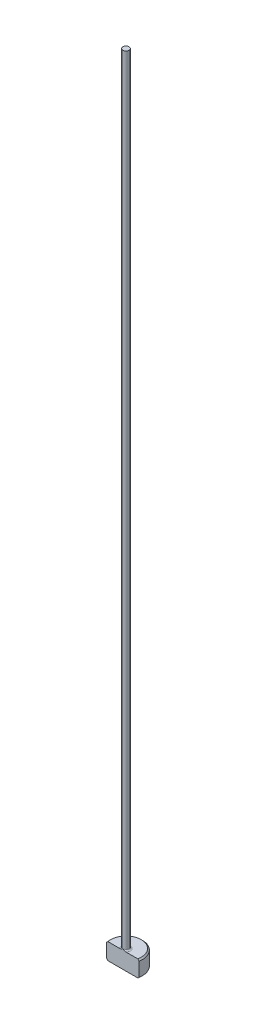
from build123d import *

# Parameters (mm, degrees)
CHAMFER1_SIZE = 0.254
FILLET1_R     = 0.254
KEY_DEPTH     = 153.466131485


with BuildPart() as part:
    # Sketch1 → Revolve1 (revolve)
    with BuildSketch(Plane.XY, mode=Mode.PRIVATE) as revolve1_sk:
        Polygon((0, 0), (-3.175, 0), (-3.175, 3.175), (-0.59436, 3.175), (-0.59436, 152.4), (0, 152.4), align=None)
    revolve(revolve1_sk.sketch.rotate(Axis((0, 259.958771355, 0), (0, -1, 0)), 270), axis=Axis((0, 259.958771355, 0), (0, -1, 0)))

    # Chamfer1
    chamfer1_edges = [part.edges().sort_by_distance(p)[0] for p in [
        (0, 3.175, -3.175),
        (0, 0, -3.175),
    ]]
    chamfer(chamfer1_edges, length=CHAMFER1_SIZE)

    # Fillet1
    fillet1_edges = [part.edges().sort_by_distance(p)[0] for p in [
        (0, 3.175, -0.59436),
    ]]
    fillet(fillet1_edges, radius=FILLET1_R)

    # Sketch2 → Key (cut, through all)
    with BuildSketch(Plane(origin=(0, 0, 0), x_dir=(1, 0, 0), z_dir=(0, 1, 0))):
        with BuildLine():
            Line((-3.118871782, -0.59436), (3.118871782, -0.59436))
            ThreePointArc((3.118871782, -0.59436), (0, -3.175), (-3.118871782, -0.59436))
        make_face()
    extrude(amount=KEY_DEPTH, mode=Mode.SUBTRACT)


solid = part.part
